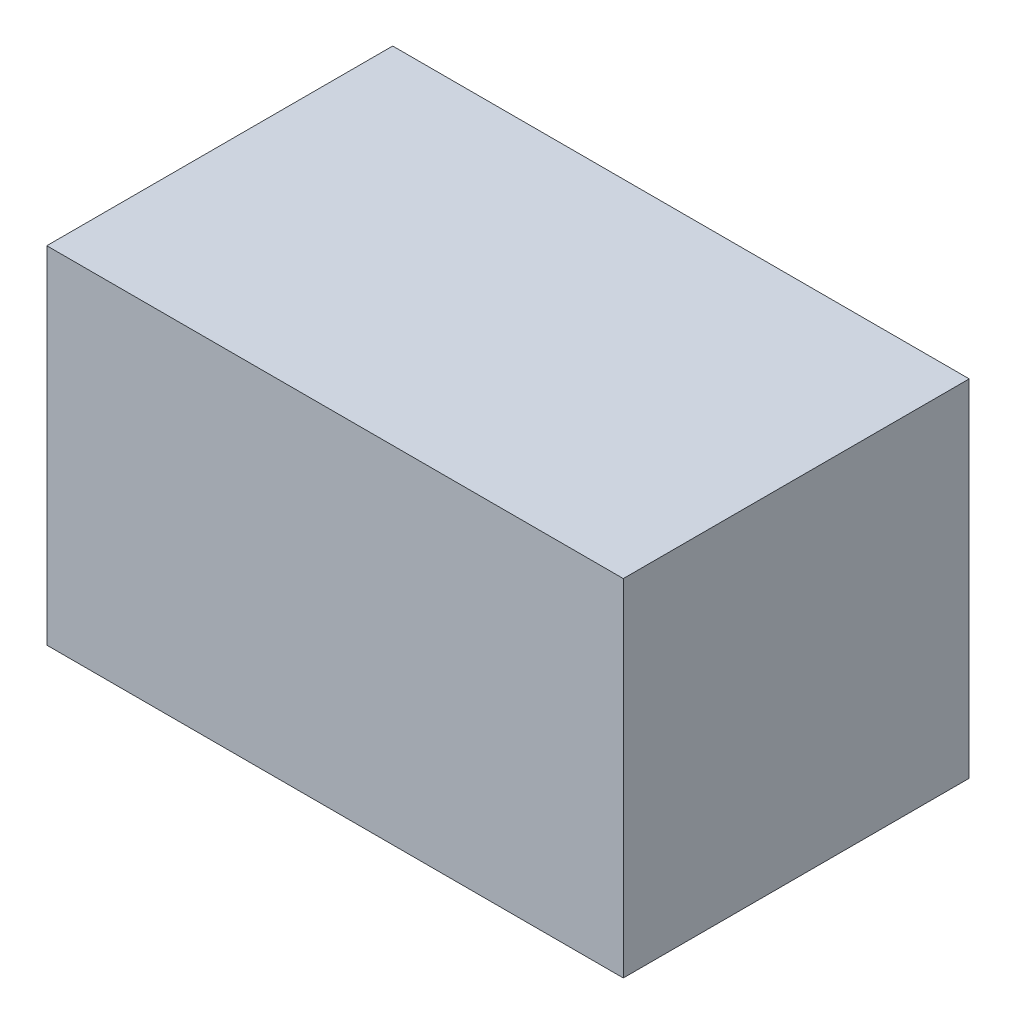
from build123d import *

# Parameters (mm, degrees)
SKETCH_1_W      = 50
SKETCH_1_H      = 30
EXTRUDE_1_DEPTH = 15


with BuildPart() as part:
    # Sketch 1 → Extrude 1 (new, symmetric)
    with BuildSketch(Plane(origin=(0, 0, 0), x_dir=(1, 0, 0), z_dir=(0, 1, 0))):
        Rectangle(SKETCH_1_W, SKETCH_1_H)
    extrude(amount=EXTRUDE_1_DEPTH, both=True)


solid = part.part
